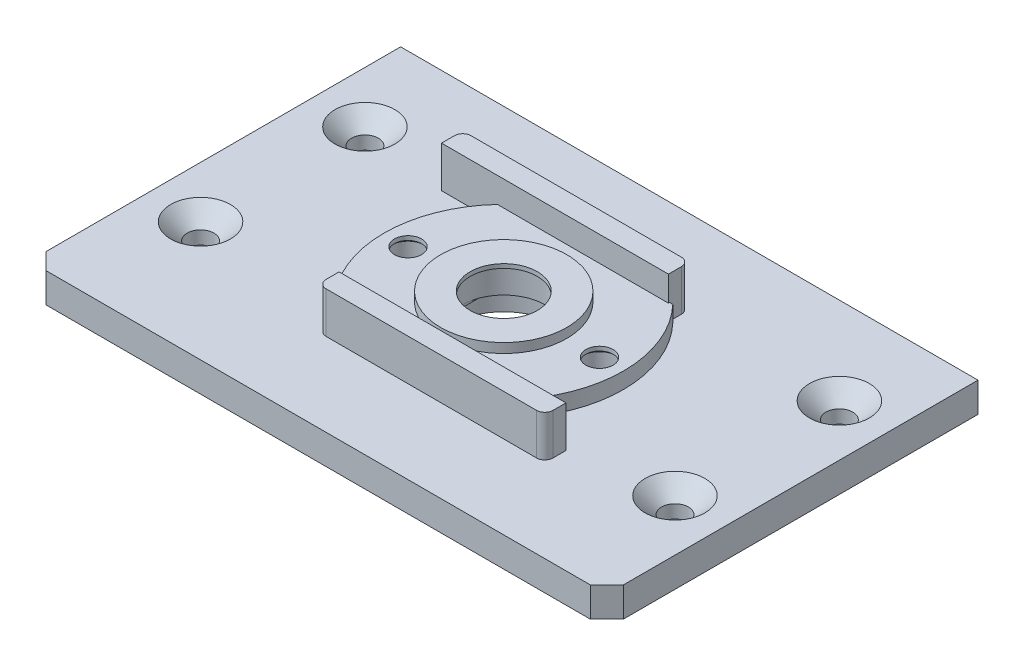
ISO-10303-21;
HEADER;
FILE_DESCRIPTION(('STEP AP214'),'2;1');
FILE_NAME('part.step','',(''),(''),'','','');
FILE_SCHEMA(('AUTOMOTIVE_DESIGN { 1 0 10303 214 1 1 1 1 }'));
ENDSEC;
DATA;
#1=APPLICATION_CONTEXT('core data for automotive mechanical design processes');
#2=APPLICATION_PROTOCOL_DEFINITION('international standard','automotive_design',2000,#1);
#3=PRODUCT_CONTEXT('',#1,'mechanical');
#4=PRODUCT('Part','Part','',(#3));
#5=PRODUCT_RELATED_PRODUCT_CATEGORY('part','',(#4));
#6=PRODUCT_DEFINITION_FORMATION('','',#4);
#7=PRODUCT_DEFINITION_CONTEXT('part definition',#1,'design');
#8=PRODUCT_DEFINITION('design','',#6,#7);
#9=PRODUCT_DEFINITION_SHAPE('','',#8);
#10=(LENGTH_UNIT() NAMED_UNIT(*) SI_UNIT(.MILLI.,.METRE.));
#11=(NAMED_UNIT(*) PLANE_ANGLE_UNIT() SI_UNIT($,.RADIAN.));
#12=(NAMED_UNIT(*) SI_UNIT($,.STERADIAN.) SOLID_ANGLE_UNIT());
#13=UNCERTAINTY_MEASURE_WITH_UNIT(LENGTH_MEASURE(1.E-05),#10,'distance_accuracy_value','');
#14=(GEOMETRIC_REPRESENTATION_CONTEXT(3) GLOBAL_UNCERTAINTY_ASSIGNED_CONTEXT((#13)) GLOBAL_UNIT_ASSIGNED_CONTEXT((#10,
#11,#12)) REPRESENTATION_CONTEXT('',''));
#15=CARTESIAN_POINT('',(0.,0.,0.));
#16=DIRECTION('',(0.,0.,1.));
#17=DIRECTION('',(1.,0.,0.));
#18=AXIS2_PLACEMENT_3D('',#15,#16,#17);
#19=CARTESIAN_POINT('',(0.,-3.6,0.));
#20=DIRECTION('',(0.,1.,0.));
#21=DIRECTION('',(0.,0.,1.));
#22=AXIS2_PLACEMENT_3D('',#19,#20,#21);
#23=CYLINDRICAL_SURFACE('',#22,5.075);
#24=CARTESIAN_POINT('',(0.,2.603,0.));
#25=DIRECTION('',(0.,1.,0.));
#26=DIRECTION('',(0.,0.,1.));
#27=AXIS2_PLACEMENT_3D('',#24,#25,#26);
#28=CIRCLE('',#27,5.075);
#29=CARTESIAN_POINT('',(0.,2.603,5.07499999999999));
#30=VERTEX_POINT('',#29);
#31=EDGE_CURVE('E537',#30,#30,#28,.F.);
#32=ORIENTED_EDGE('',*,*,#31,.F.);
#33=EDGE_LOOP('',(#32));
#34=FACE_BOUND('',#33,.T.);
#35=CARTESIAN_POINT('',(0.,-0.9,0.));
#36=DIRECTION('',(0.,-1.,0.));
#37=DIRECTION('',(0.,0.,-1.));
#38=AXIS2_PLACEMENT_3D('',#35,#36,#37);
#39=CIRCLE('',#38,5.075);
#40=CARTESIAN_POINT('',(5.07499999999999,-0.9,0.));
#41=VERTEX_POINT('',#40);
#42=CARTESIAN_POINT('',(-5.07500000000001,-0.9,0.));
#43=VERTEX_POINT('',#42);
#44=EDGE_CURVE('E274',#41,#43,#39,.T.);
#45=ORIENTED_EDGE('',*,*,#44,.T.);
#46=CARTESIAN_POINT('',(0.,-0.9,0.));
#47=DIRECTION('',(0.,-1.,0.));
#48=DIRECTION('',(0.,0.,-1.));
#49=AXIS2_PLACEMENT_3D('',#46,#47,#48);
#50=CIRCLE('',#49,5.075);
#51=EDGE_CURVE('E279',#43,#41,#50,.T.);
#52=ORIENTED_EDGE('',*,*,#51,.T.);
#53=EDGE_LOOP('',(#45,#52));
#54=FACE_BOUND('',#53,.T.);
#55=ADVANCED_FACE('F43',(#34,#54),#23,.F.);
#56=CARTESIAN_POINT('',(0.,-1.2,0.));
#57=DIRECTION('',(0.,-1.,0.));
#58=DIRECTION('',(0.,0.,-1.));
#59=AXIS2_PLACEMENT_3D('',#56,#57,#58);
#60=PLANE('',#59);
#61=CARTESIAN_POINT('',(0.,-1.2,0.));
#62=DIRECTION('',(0.,-1.,0.));
#63=DIRECTION('',(0.,0.,-1.));
#64=AXIS2_PLACEMENT_3D('',#61,#62,#63);
#65=CIRCLE('',#64,6.404);
#66=CARTESIAN_POINT('',(5.07499999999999,-1.2,-3.90584062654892));
#67=VERTEX_POINT('',#66);
#68=CARTESIAN_POINT('',(5.07499999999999,-1.2,3.9058406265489));
#69=VERTEX_POINT('',#68);
#70=EDGE_CURVE('E285',#67,#69,#65,.T.);
#71=ORIENTED_EDGE('',*,*,#70,.T.);
#72=DIRECTION('',(0.,0.,-1.));
#73=VECTOR('',#72,1.);
#74=CARTESIAN_POINT('',(5.07499999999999,-1.2,0.));
#75=LINE('',#74,#73);
#76=EDGE_CURVE('E11',#69,#67,#75,.T.);
#77=ORIENTED_EDGE('',*,*,#76,.T.);
#78=EDGE_LOOP('',(#71,#77));
#79=FACE_BOUND('',#78,.T.);
#80=ADVANCED_FACE('F560',(#79),#60,.T.);
#81=CARTESIAN_POINT('',(-11.608,1.95,0.));
#82=DIRECTION('',(0.,-1.,0.));
#83=DIRECTION('',(0.,0.,-1.));
#84=AXIS2_PLACEMENT_3D('',#81,#82,#83);
#85=CYLINDRICAL_SURFACE('',#84,2.1);
#86=CARTESIAN_POINT('',(-11.608,1.05000000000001,0.));
#87=DIRECTION('',(0.,1.,0.));
#88=DIRECTION('',(0.,0.,1.));
#89=AXIS2_PLACEMENT_3D('',#86,#87,#88);
#90=CIRCLE('',#89,2.1);
#91=CARTESIAN_POINT('',(-11.608,1.05000000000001,2.1));
#92=VERTEX_POINT('',#91);
#93=EDGE_CURVE('E247',#92,#92,#90,.T.);
#94=ORIENTED_EDGE('',*,*,#93,.T.);
#95=EDGE_LOOP('',(#94));
#96=FACE_BOUND('',#95,.T.);
#97=CARTESIAN_POINT('',(-11.608,-3.6,0.));
#98=DIRECTION('',(0.,-1.,0.));
#99=DIRECTION('',(0.,0.,-1.));
#100=AXIS2_PLACEMENT_3D('',#97,#98,#99);
#101=CIRCLE('',#100,2.1);
#102=CARTESIAN_POINT('',(-11.608,-3.6,-2.1));
#103=VERTEX_POINT('',#102);
#104=EDGE_CURVE('E324',#103,#103,#101,.F.);
#105=ORIENTED_EDGE('',*,*,#104,.F.);
#106=EDGE_LOOP('',(#105));
#107=FACE_BOUND('',#106,.T.);
#108=ADVANCED_FACE('F567',(#96,#107),#85,.F.);
#109=CARTESIAN_POINT('',(11.608,1.95,0.));
#110=DIRECTION('',(0.,-1.,0.));
#111=DIRECTION('',(0.,0.,-1.));
#112=AXIS2_PLACEMENT_3D('',#109,#110,#111);
#113=CYLINDRICAL_SURFACE('',#112,2.1);
#114=CARTESIAN_POINT('',(11.608,1.05000000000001,0.));
#115=DIRECTION('',(0.,1.,0.));
#116=DIRECTION('',(0.,0.,1.));
#117=AXIS2_PLACEMENT_3D('',#114,#115,#116);
#118=CIRCLE('',#117,2.1);
#119=CARTESIAN_POINT('',(11.608,1.05000000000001,2.1));
#120=VERTEX_POINT('',#119);
#121=EDGE_CURVE('E489',#120,#120,#118,.T.);
#122=ORIENTED_EDGE('',*,*,#121,.T.);
#123=EDGE_LOOP('',(#122));
#124=FACE_BOUND('',#123,.T.);
#125=CARTESIAN_POINT('',(11.608,-3.6,0.));
#126=DIRECTION('',(0.,-1.,0.));
#127=DIRECTION('',(0.,0.,-1.));
#128=AXIS2_PLACEMENT_3D('',#125,#126,#127);
#129=CIRCLE('',#128,2.1);
#130=CARTESIAN_POINT('',(11.608,-3.6,-2.1));
#131=VERTEX_POINT('',#130);
#132=EDGE_CURVE('E327',#131,#131,#129,.F.);
#133=ORIENTED_EDGE('',*,*,#132,.F.);
#134=EDGE_LOOP('',(#133));
#135=FACE_BOUND('',#134,.T.);
#136=ADVANCED_FACE('F629',(#124,#135),#113,.F.);
#137=CARTESIAN_POINT('',(0.,-3.6,0.));
#138=DIRECTION('',(0.,1.,0.));
#139=DIRECTION('',(0.,0.,1.));
#140=AXIS2_PLACEMENT_3D('',#137,#138,#139);
#141=CYLINDRICAL_SURFACE('',#140,6.404);
#142=DIRECTION('',(0.,1.,0.));
#143=VECTOR('',#142,1.);
#144=CARTESIAN_POINT('',(5.07499999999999,-3.6,-3.90584062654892));
#145=LINE('',#144,#143);
#146=CARTESIAN_POINT('',(5.07499999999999,-0.9,-3.90584062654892));
#147=VERTEX_POINT('',#146);
#148=EDGE_CURVE('E59',#67,#147,#145,.T.);
#149=ORIENTED_EDGE('',*,*,#148,.T.);
#150=CARTESIAN_POINT('',(0.,-0.9,0.));
#151=DIRECTION('',(0.,-1.,0.));
#152=DIRECTION('',(0.,0.,-1.));
#153=AXIS2_PLACEMENT_3D('',#150,#151,#152);
#154=CIRCLE('',#153,6.404);
#155=CARTESIAN_POINT('',(-5.07500000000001,-0.9,-3.90584062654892));
#156=VERTEX_POINT('',#155);
#157=EDGE_CURVE('E248',#156,#147,#154,.T.);
#158=ORIENTED_EDGE('',*,*,#157,.F.);
#159=DIRECTION('',(0.,1.,0.));
#160=VECTOR('',#159,1.);
#161=CARTESIAN_POINT('',(-5.07500000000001,-3.6,-3.90584062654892));
#162=LINE('',#161,#160);
#163=CARTESIAN_POINT('',(-5.07500000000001,-1.2,-3.90584062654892));
#164=VERTEX_POINT('',#163);
#165=EDGE_CURVE('E66',#164,#156,#162,.T.);
#166=ORIENTED_EDGE('',*,*,#165,.F.);
#167=CARTESIAN_POINT('',(0.,-1.2,0.));
#168=DIRECTION('',(0.,-1.,0.));
#169=DIRECTION('',(0.,0.,-1.));
#170=AXIS2_PLACEMENT_3D('',#167,#168,#169);
#171=CIRCLE('',#170,6.404);
#172=CARTESIAN_POINT('',(-5.07500000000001,-1.2,3.9058406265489));
#173=VERTEX_POINT('',#172);
#174=EDGE_CURVE('E255',#173,#164,#171,.T.);
#175=ORIENTED_EDGE('',*,*,#174,.F.);
#176=DIRECTION('',(0.,1.,0.));
#177=VECTOR('',#176,1.);
#178=CARTESIAN_POINT('',(-5.07500000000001,-3.6,3.9058406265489));
#179=LINE('',#178,#177);
#180=CARTESIAN_POINT('',(-5.07500000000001,-0.9,3.9058406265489));
#181=VERTEX_POINT('',#180);
#182=EDGE_CURVE('E251',#173,#181,#179,.T.);
#183=ORIENTED_EDGE('',*,*,#182,.T.);
#184=CARTESIAN_POINT('',(5.07499999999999,-0.9,3.9058406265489));
#185=VERTEX_POINT('',#184);
#186=EDGE_CURVE('E236',#185,#181,#154,.T.);
#187=ORIENTED_EDGE('',*,*,#186,.F.);
#188=DIRECTION('',(0.,1.,0.));
#189=VECTOR('',#188,1.);
#190=CARTESIAN_POINT('',(5.07499999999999,-3.6,3.9058406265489));
#191=LINE('',#190,#189);
#192=EDGE_CURVE('E267',#69,#185,#191,.T.);
#193=ORIENTED_EDGE('',*,*,#192,.F.);
#194=ORIENTED_EDGE('',*,*,#70,.F.);
#195=EDGE_LOOP('',(#149,#158,#166,#175,#183,#187,#193,#194));
#196=FACE_BOUND('',#195,.T.);
#197=CARTESIAN_POINT('',(0.,-3.6,0.));
#198=DIRECTION('',(0.,-1.,0.));
#199=DIRECTION('',(0.,0.,-1.));
#200=AXIS2_PLACEMENT_3D('',#197,#198,#199);
#201=CIRCLE('',#200,6.404);
#202=CARTESIAN_POINT('',(0.,-3.6,-6.40400000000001));
#203=VERTEX_POINT('',#202);
#204=EDGE_CURVE('E321',#203,#203,#201,.T.);
#205=ORIENTED_EDGE('',*,*,#204,.T.);
#206=EDGE_LOOP('',(#205));
#207=FACE_BOUND('',#206,.T.);
#208=ADVANCED_FACE('F252',(#196,#207),#141,.F.);
#209=CARTESIAN_POINT('',(0.,-0.9,0.));
#210=DIRECTION('',(0.,-1.,0.));
#211=DIRECTION('',(0.,0.,-1.));
#212=AXIS2_PLACEMENT_3D('',#209,#210,#211);
#213=PLANE('',#212);
#214=ORIENTED_EDGE('',*,*,#51,.F.);
#215=DIRECTION('',(0.,0.,1.));
#216=VECTOR('',#215,1.);
#217=CARTESIAN_POINT('',(-5.07500000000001,-0.9,0.));
#218=LINE('',#217,#216);
#219=EDGE_CURVE('E261',#156,#43,#218,.T.);
#220=ORIENTED_EDGE('',*,*,#219,.F.);
#221=ORIENTED_EDGE('',*,*,#157,.T.);
#222=DIRECTION('',(0.,0.,1.));
#223=VECTOR('',#222,1.);
#224=CARTESIAN_POINT('',(5.07499999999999,-0.9,0.));
#225=LINE('',#224,#223);
#226=EDGE_CURVE('E264',#147,#41,#225,.T.);
#227=ORIENTED_EDGE('',*,*,#226,.T.);
#228=EDGE_LOOP('',(#214,#220,#221,#227));
#229=FACE_BOUND('',#228,.T.);
#230=ADVANCED_FACE('F899',(#229),#213,.T.);
#231=ORIENTED_EDGE('',*,*,#44,.F.);
#232=EDGE_CURVE('E244',#41,#185,#225,.T.);
#233=ORIENTED_EDGE('',*,*,#232,.T.);
#234=ORIENTED_EDGE('',*,*,#186,.T.);
#235=EDGE_CURVE('E241',#43,#181,#218,.T.);
#236=ORIENTED_EDGE('',*,*,#235,.F.);
#237=EDGE_LOOP('',(#231,#233,#234,#236));
#238=FACE_BOUND('',#237,.T.);
#239=ADVANCED_FACE('F239',(#238),#213,.T.);
#240=CARTESIAN_POINT('',(0.,1.95,0.));
#241=DIRECTION('',(0.,-1.,0.));
#242=DIRECTION('',(0.,0.,-1.));
#243=AXIS2_PLACEMENT_3D('',#240,#241,#242);
#244=CYLINDRICAL_SURFACE('',#243,14.5);
#245=DIRECTION('',(0.,-1.,0.));
#246=VECTOR('',#245,1.);
#247=CARTESIAN_POINT('',(10.6260079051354,1.95,9.866));
#248=LINE('',#247,#246);
#249=CARTESIAN_POINT('',(10.6260079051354,0.,9.866));
#250=VERTEX_POINT('',#249);
#251=CARTESIAN_POINT('',(10.6260079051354,1.95,9.866));
#252=VERTEX_POINT('',#251);
#253=EDGE_CURVE('E401',#250,#252,#248,.F.);
#254=ORIENTED_EDGE('',*,*,#253,.F.);
#255=CARTESIAN_POINT('',(0.,0.,0.));
#256=DIRECTION('',(0.,1.,0.));
#257=DIRECTION('',(0.,0.,1.));
#258=AXIS2_PLACEMENT_3D('',#255,#256,#257);
#259=CIRCLE('',#258,14.5);
#260=CARTESIAN_POINT('',(10.5,0.,-10.));
#261=VERTEX_POINT('',#260);
#262=EDGE_CURVE('E425',#250,#261,#259,.T.);
#263=ORIENTED_EDGE('',*,*,#262,.T.);
#264=DIRECTION('',(0.,-1.,0.));
#265=VECTOR('',#264,1.);
#266=CARTESIAN_POINT('',(10.5,1.95,-10.));
#267=LINE('',#266,#265);
#268=CARTESIAN_POINT('',(10.5,1.95,-10.));
#269=VERTEX_POINT('',#268);
#270=EDGE_CURVE('E432',#269,#261,#267,.T.);
#271=ORIENTED_EDGE('',*,*,#270,.F.);
#272=CARTESIAN_POINT('',(0.,1.95,0.));
#273=DIRECTION('',(0.,1.,0.));
#274=DIRECTION('',(0.,0.,1.));
#275=AXIS2_PLACEMENT_3D('',#272,#273,#274);
#276=CIRCLE('',#275,14.5);
#277=EDGE_CURVE('E417',#252,#269,#276,.T.);
#278=ORIENTED_EDGE('',*,*,#277,.F.);
#279=EDGE_LOOP('',(#254,#263,#271,#278));
#280=FACE_BOUND('',#279,.T.);
#281=ADVANCED_FACE('F607',(#280),#244,.T.);
#282=DIRECTION('',(0.,-1.,0.));
#283=VECTOR('',#282,1.);
#284=CARTESIAN_POINT('',(-10.6260079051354,1.95,-9.866));
#285=LINE('',#284,#283);
#286=CARTESIAN_POINT('',(-10.6260079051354,0.,-9.866));
#287=VERTEX_POINT('',#286);
#288=CARTESIAN_POINT('',(-10.6260079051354,1.95,-9.866));
#289=VERTEX_POINT('',#288);
#290=EDGE_CURVE('E407',#287,#289,#285,.F.);
#291=ORIENTED_EDGE('',*,*,#290,.F.);
#292=CARTESIAN_POINT('',(-10.5,0.,10.));
#293=VERTEX_POINT('',#292);
#294=EDGE_CURVE('E415',#287,#293,#259,.T.);
#295=ORIENTED_EDGE('',*,*,#294,.T.);
#296=DIRECTION('',(0.,-1.,0.));
#297=VECTOR('',#296,1.);
#298=CARTESIAN_POINT('',(-10.5,1.95,10.));
#299=LINE('',#298,#297);
#300=CARTESIAN_POINT('',(-10.5,1.95,10.));
#301=VERTEX_POINT('',#300);
#302=EDGE_CURVE('E420',#301,#293,#299,.T.);
#303=ORIENTED_EDGE('',*,*,#302,.F.);
#304=EDGE_CURVE('E418',#289,#301,#276,.T.);
#305=ORIENTED_EDGE('',*,*,#304,.F.);
#306=EDGE_LOOP('',(#291,#295,#303,#305));
#307=FACE_BOUND('',#306,.T.);
#308=ADVANCED_FACE('F595',(#307),#244,.T.);
#309=CARTESIAN_POINT('',(0.,1.95,0.));
#310=DIRECTION('',(0.,1.,0.));
#311=DIRECTION('',(0.,0.,1.));
#312=AXIS2_PLACEMENT_3D('',#309,#310,#311);
#313=PLANE('',#312);
#314=CARTESIAN_POINT('',(0.,1.95,0.));
#315=DIRECTION('',(0.,1.,0.));
#316=DIRECTION('',(0.,0.,1.));
#317=AXIS2_PLACEMENT_3D('',#314,#315,#316);
#318=CIRCLE('',#317,7.65);
#319=CARTESIAN_POINT('',(0.,1.95,7.64999999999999));
#320=VERTEX_POINT('',#319);
#321=EDGE_CURVE('E411',#320,#320,#318,.T.);
#322=ORIENTED_EDGE('',*,*,#321,.F.);
#323=EDGE_LOOP('',(#322));
#324=FACE_BOUND('',#323,.T.);
#325=DIRECTION('',(0.,0.,-1.));
#326=VECTOR('',#325,1.);
#327=CARTESIAN_POINT('',(10.099911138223,1.95,0.));
#328=LINE('',#327,#326);
#329=CARTESIAN_POINT('',(10.099911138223,1.95,-9.866));
#330=VERTEX_POINT('',#329);
#331=CARTESIAN_POINT('',(10.099911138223,1.95,-10.));
#332=VERTEX_POINT('',#331);
#333=EDGE_CURVE('E443',#330,#332,#328,.T.);
#334=ORIENTED_EDGE('',*,*,#333,.F.);
#335=DIRECTION('',(-1.,0.,0.));
#336=VECTOR('',#335,1.);
#337=CARTESIAN_POINT('',(0.,1.95,-9.866));
#338=LINE('',#337,#336);
#339=EDGE_CURVE('E446',#330,#289,#338,.T.);
#340=ORIENTED_EDGE('',*,*,#339,.T.);
#341=ORIENTED_EDGE('',*,*,#304,.T.);
#342=DIRECTION('',(1.,0.,0.));
#343=VECTOR('',#342,1.);
#344=CARTESIAN_POINT('',(0.,1.95,10.));
#345=LINE('',#344,#343);
#346=CARTESIAN_POINT('',(-10.099911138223,1.95,10.));
#347=VERTEX_POINT('',#346);
#348=EDGE_CURVE('E414',#301,#347,#345,.T.);
#349=ORIENTED_EDGE('',*,*,#348,.T.);
#350=DIRECTION('',(0.,0.,1.));
#351=VECTOR('',#350,1.);
#352=CARTESIAN_POINT('',(-10.099911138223,1.95,0.));
#353=LINE('',#352,#351);
#354=CARTESIAN_POINT('',(-10.099911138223,1.95,9.86599999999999));
#355=VERTEX_POINT('',#354);
#356=EDGE_CURVE('E438',#355,#347,#353,.T.);
#357=ORIENTED_EDGE('',*,*,#356,.F.);
#358=DIRECTION('',(1.,0.,0.));
#359=VECTOR('',#358,1.);
#360=CARTESIAN_POINT('',(0.,1.95,9.866));
#361=LINE('',#360,#359);
#362=EDGE_CURVE('E441',#355,#252,#361,.T.);
#363=ORIENTED_EDGE('',*,*,#362,.T.);
#364=ORIENTED_EDGE('',*,*,#277,.T.);
#365=DIRECTION('',(1.,0.,0.));
#366=VECTOR('',#365,1.);
#367=CARTESIAN_POINT('',(0.,1.95,-10.));
#368=LINE('',#367,#366);
#369=EDGE_CURVE('E421',#332,#269,#368,.T.);
#370=ORIENTED_EDGE('',*,*,#369,.F.);
#371=EDGE_LOOP('',(#334,#340,#341,#349,#357,#363,#364,#370));
#372=FACE_BOUND('',#371,.T.);
#373=CARTESIAN_POINT('',(11.608,1.95,0.));
#374=DIRECTION('',(0.,1.,0.));
#375=DIRECTION('',(0.,0.,1.));
#376=AXIS2_PLACEMENT_3D('',#373,#374,#375);
#377=CIRCLE('',#376,1.65);
#378=CARTESIAN_POINT('',(11.608,1.95,1.65));
#379=VERTEX_POINT('',#378);
#380=EDGE_CURVE('E289',#379,#379,#377,.T.);
#381=ORIENTED_EDGE('',*,*,#380,.F.);
#382=EDGE_LOOP('',(#381));
#383=FACE_BOUND('',#382,.T.);
#384=CARTESIAN_POINT('',(-11.608,1.95,0.));
#385=DIRECTION('',(0.,1.,0.));
#386=DIRECTION('',(0.,0.,1.));
#387=AXIS2_PLACEMENT_3D('',#384,#385,#386);
#388=CIRCLE('',#387,1.65);
#389=CARTESIAN_POINT('',(-11.608,1.95,1.65));
#390=VERTEX_POINT('',#389);
#391=EDGE_CURVE('E286',#390,#390,#388,.T.);
#392=ORIENTED_EDGE('',*,*,#391,.F.);
#393=EDGE_LOOP('',(#392));
#394=FACE_BOUND('',#393,.T.);
#395=ADVANCED_FACE('F592',(#324,#372,#383,#394),#313,.T.);
#396=CARTESIAN_POINT('',(0.,3.103,0.));
#397=DIRECTION('',(0.,-1.,0.));
#398=DIRECTION('',(0.,0.,-1.));
#399=AXIS2_PLACEMENT_3D('',#396,#397,#398);
#400=CYLINDRICAL_SURFACE('',#399,7.65);
#401=ORIENTED_EDGE('',*,*,#321,.T.);
#402=EDGE_LOOP('',(#401));
#403=FACE_BOUND('',#402,.T.);
#404=CARTESIAN_POINT('',(0.,3.103,0.));
#405=DIRECTION('',(0.,1.,0.));
#406=DIRECTION('',(0.,0.,1.));
#407=AXIS2_PLACEMENT_3D('',#404,#405,#406);
#408=CIRCLE('',#407,7.65);
#409=CARTESIAN_POINT('',(0.,3.103,7.64999999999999));
#410=VERTEX_POINT('',#409);
#411=EDGE_CURVE('E435',#410,#410,#408,.T.);
#412=ORIENTED_EDGE('',*,*,#411,.F.);
#413=EDGE_LOOP('',(#412));
#414=FACE_BOUND('',#413,.T.);
#415=ADVANCED_FACE('F594',(#403,#414),#400,.T.);
#416=CARTESIAN_POINT('',(0.,3.103,0.));
#417=DIRECTION('',(0.,1.,0.));
#418=DIRECTION('',(0.,0.,1.));
#419=AXIS2_PLACEMENT_3D('',#416,#417,#418);
#420=PLANE('',#419);
#421=ORIENTED_EDGE('',*,*,#411,.T.);
#422=EDGE_LOOP('',(#421));
#423=FACE_BOUND('',#422,.T.);
#424=CARTESIAN_POINT('',(0.,3.103,0.));
#425=DIRECTION('',(0.,1.,0.));
#426=DIRECTION('',(0.,0.,1.));
#427=AXIS2_PLACEMENT_3D('',#424,#425,#426);
#428=CIRCLE('',#427,4.075);
#429=CARTESIAN_POINT('',(0.,3.103,4.07499999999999));
#430=VERTEX_POINT('',#429);
#431=EDGE_CURVE('E257',#430,#430,#428,.T.);
#432=ORIENTED_EDGE('',*,*,#431,.F.);
#433=EDGE_LOOP('',(#432));
#434=FACE_BOUND('',#433,.T.);
#435=ADVANCED_FACE('F603',(#423,#434),#420,.T.);
#436=CARTESIAN_POINT('',(0.,1.95,10.));
#437=DIRECTION('',(0.,0.,-1.));
#438=DIRECTION('',(-1.,0.,0.));
#439=AXIS2_PLACEMENT_3D('',#436,#437,#438);
#440=PLANE('',#439);
#441=DIRECTION('',(1.,0.,0.));
#442=VECTOR('',#441,1.);
#443=CARTESIAN_POINT('',(0.,0.,10.));
#444=LINE('',#443,#442);
#445=CARTESIAN_POINT('',(-10.099911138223,0.,10.));
#446=VERTEX_POINT('',#445);
#447=EDGE_CURVE('E410',#293,#446,#444,.T.);
#448=ORIENTED_EDGE('',*,*,#447,.T.);
#449=DIRECTION('',(0.,1.,0.));
#450=VECTOR('',#449,1.);
#451=CARTESIAN_POINT('',(-10.099911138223,1.95,10.));
#452=LINE('',#451,#450);
#453=EDGE_CURVE('E374',#446,#347,#452,.T.);
#454=ORIENTED_EDGE('',*,*,#453,.T.);
#455=ORIENTED_EDGE('',*,*,#348,.F.);
#456=ORIENTED_EDGE('',*,*,#302,.T.);
#457=EDGE_LOOP('',(#448,#454,#455,#456));
#458=FACE_BOUND('',#457,.T.);
#459=ADVANCED_FACE('F622',(#458),#440,.F.);
#460=CARTESIAN_POINT('',(0.,1.95,-10.));
#461=DIRECTION('',(0.,0.,-1.));
#462=DIRECTION('',(-1.,0.,0.));
#463=AXIS2_PLACEMENT_3D('',#460,#461,#462);
#464=PLANE('',#463);
#465=DIRECTION('',(0.,-1.,0.));
#466=VECTOR('',#465,1.);
#467=CARTESIAN_POINT('',(10.099911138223,1.95,-10.));
#468=LINE('',#467,#466);
#469=CARTESIAN_POINT('',(10.099911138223,0.,-10.));
#470=VERTEX_POINT('',#469);
#471=EDGE_CURVE('E404',#332,#470,#468,.T.);
#472=ORIENTED_EDGE('',*,*,#471,.F.);
#473=ORIENTED_EDGE('',*,*,#369,.T.);
#474=ORIENTED_EDGE('',*,*,#270,.T.);
#475=DIRECTION('',(1.,0.,0.));
#476=VECTOR('',#475,1.);
#477=CARTESIAN_POINT('',(0.,0.,-10.));
#478=LINE('',#477,#476);
#479=EDGE_CURVE('E428',#470,#261,#478,.T.);
#480=ORIENTED_EDGE('',*,*,#479,.F.);
#481=EDGE_LOOP('',(#472,#473,#474,#480));
#482=FACE_BOUND('',#481,.T.);
#483=ADVANCED_FACE('F618',(#482),#464,.T.);
#484=CARTESIAN_POINT('',(17.409088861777,5.,9.866));
#485=DIRECTION('',(0.,0.,1.));
#486=DIRECTION('',(1.,0.,0.));
#487=AXIS2_PLACEMENT_3D('',#484,#485,#486);
#488=PLANE('',#487);
#489=DIRECTION('',(-1.,0.,0.));
#490=VECTOR('',#489,1.);
#491=CARTESIAN_POINT('',(17.409088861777,0.,9.866));
#492=LINE('',#491,#490);
#493=CARTESIAN_POINT('',(17.409088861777,0.,9.866));
#494=VERTEX_POINT('',#493);
#495=EDGE_CURVE('E383',#494,#250,#492,.T.);
#496=ORIENTED_EDGE('',*,*,#495,.T.);
#497=ORIENTED_EDGE('',*,*,#253,.T.);
#498=ORIENTED_EDGE('',*,*,#362,.F.);
#499=DIRECTION('',(0.,-1.,0.));
#500=VECTOR('',#499,1.);
#501=CARTESIAN_POINT('',(-10.099911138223,5.,9.86599999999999));
#502=LINE('',#501,#500);
#503=CARTESIAN_POINT('',(-10.099911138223,5.,9.86599999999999));
#504=VERTEX_POINT('',#503);
#505=EDGE_CURVE('E375',#504,#355,#502,.T.);
#506=ORIENTED_EDGE('',*,*,#505,.F.);
#507=DIRECTION('',(-1.,0.,0.));
#508=VECTOR('',#507,1.);
#509=CARTESIAN_POINT('',(17.409088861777,5.,9.866));
#510=LINE('',#509,#508);
#511=CARTESIAN_POINT('',(17.409088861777,5.,9.866));
#512=VERTEX_POINT('',#511);
#513=EDGE_CURVE('E392',#512,#504,#510,.T.);
#514=ORIENTED_EDGE('',*,*,#513,.F.);
#515=DIRECTION('',(0.,-1.,0.));
#516=VECTOR('',#515,1.);
#517=CARTESIAN_POINT('',(17.409088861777,5.,9.866));
#518=LINE('',#517,#516);
#519=EDGE_CURVE('E346',#512,#494,#518,.T.);
#520=ORIENTED_EDGE('',*,*,#519,.T.);
#521=EDGE_LOOP('',(#496,#497,#498,#506,#514,#520));
#522=FACE_BOUND('',#521,.T.);
#523=ADVANCED_FACE('F621',(#522),#488,.F.);
#524=CARTESIAN_POINT('',(-10.099911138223,5.,12.432));
#525=DIRECTION('',(-1.,0.,0.));
#526=DIRECTION('',(0.,0.,1.));
#527=AXIS2_PLACEMENT_3D('',#524,#525,#526);
#528=PLANE('',#527);
#529=DIRECTION('',(0.,0.,-1.));
#530=VECTOR('',#529,1.);
#531=CARTESIAN_POINT('',(-10.099911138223,0.,12.432));
#532=LINE('',#531,#530);
#533=CARTESIAN_POINT('',(-10.099911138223,0.,11.432));
#534=VERTEX_POINT('',#533);
#535=EDGE_CURVE('E387',#534,#446,#532,.T.);
#536=ORIENTED_EDGE('',*,*,#535,.F.);
#537=DIRECTION('',(0.,-1.,0.));
#538=VECTOR('',#537,1.);
#539=CARTESIAN_POINT('',(-10.099911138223,5.,11.432));
#540=LINE('',#539,#538);
#541=CARTESIAN_POINT('',(-10.099911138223,5.,11.432));
#542=VERTEX_POINT('',#541);
#543=EDGE_CURVE('E474',#534,#542,#540,.F.);
#544=ORIENTED_EDGE('',*,*,#543,.T.);
#545=DIRECTION('',(0.,0.,-1.));
#546=VECTOR('',#545,1.);
#547=CARTESIAN_POINT('',(-10.099911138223,5.,12.432));
#548=LINE('',#547,#546);
#549=EDGE_CURVE('E395',#542,#504,#548,.T.);
#550=ORIENTED_EDGE('',*,*,#549,.T.);
#551=ORIENTED_EDGE('',*,*,#505,.T.);
#552=ORIENTED_EDGE('',*,*,#356,.T.);
#553=ORIENTED_EDGE('',*,*,#453,.F.);
#554=EDGE_LOOP('',(#536,#544,#550,#551,#552,#553));
#555=FACE_BOUND('',#554,.T.);
#556=ADVANCED_FACE('F789',(#555),#528,.T.);
#557=CARTESIAN_POINT('',(17.409088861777,5.,12.432));
#558=DIRECTION('',(0.,0.,1.));
#559=DIRECTION('',(1.,0.,0.));
#560=AXIS2_PLACEMENT_3D('',#557,#558,#559);
#561=PLANE('',#560);
#562=DIRECTION('',(-1.,0.,0.));
#563=VECTOR('',#562,1.);
#564=CARTESIAN_POINT('',(17.409088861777,0.,12.432));
#565=LINE('',#564,#563);
#566=CARTESIAN_POINT('',(16.409088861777,0.,12.432));
#567=VERTEX_POINT('',#566);
#568=CARTESIAN_POINT('',(-9.09991113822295,0.,12.432));
#569=VERTEX_POINT('',#568);
#570=EDGE_CURVE('E362',#567,#569,#565,.T.);
#571=ORIENTED_EDGE('',*,*,#570,.F.);
#572=DIRECTION('',(0.,-1.,0.));
#573=VECTOR('',#572,1.);
#574=CARTESIAN_POINT('',(16.409088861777,5.,12.432));
#575=LINE('',#574,#573);
#576=CARTESIAN_POINT('',(16.409088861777,5.,12.432));
#577=VERTEX_POINT('',#576);
#578=EDGE_CURVE('E468',#567,#577,#575,.F.);
#579=ORIENTED_EDGE('',*,*,#578,.T.);
#580=DIRECTION('',(-1.,0.,0.));
#581=VECTOR('',#580,1.);
#582=CARTESIAN_POINT('',(17.409088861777,5.,12.432));
#583=LINE('',#582,#581);
#584=CARTESIAN_POINT('',(-9.09991113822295,5.,12.432));
#585=VERTEX_POINT('',#584);
#586=EDGE_CURVE('E384',#577,#585,#583,.T.);
#587=ORIENTED_EDGE('',*,*,#586,.T.);
#588=DIRECTION('',(0.,-1.,0.));
#589=VECTOR('',#588,1.);
#590=CARTESIAN_POINT('',(-9.09991113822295,5.,12.432));
#591=LINE('',#590,#589);
#592=EDGE_CURVE('E465',#585,#569,#591,.T.);
#593=ORIENTED_EDGE('',*,*,#592,.T.);
#594=EDGE_LOOP('',(#571,#579,#587,#593));
#595=FACE_BOUND('',#594,.T.);
#596=ADVANCED_FACE('F785',(#595),#561,.T.);
#597=CARTESIAN_POINT('',(17.409088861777,5.,12.432));
#598=DIRECTION('',(-1.,0.,0.));
#599=DIRECTION('',(0.,0.,1.));
#600=AXIS2_PLACEMENT_3D('',#597,#598,#599);
#601=PLANE('',#600);
#602=DIRECTION('',(0.,0.,-1.));
#603=VECTOR('',#602,1.);
#604=CARTESIAN_POINT('',(17.409088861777,5.,12.432));
#605=LINE('',#604,#603);
#606=CARTESIAN_POINT('',(17.409088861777,5.,11.432));
#607=VERTEX_POINT('',#606);
#608=EDGE_CURVE('E378',#607,#512,#605,.T.);
#609=ORIENTED_EDGE('',*,*,#608,.F.);
#610=DIRECTION('',(0.,-1.,0.));
#611=VECTOR('',#610,1.);
#612=CARTESIAN_POINT('',(17.409088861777,0.,11.432));
#613=LINE('',#612,#611);
#614=CARTESIAN_POINT('',(17.409088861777,0.,11.432));
#615=VERTEX_POINT('',#614);
#616=EDGE_CURVE('E462',#607,#615,#613,.T.);
#617=ORIENTED_EDGE('',*,*,#616,.T.);
#618=DIRECTION('',(0.,0.,-1.));
#619=VECTOR('',#618,1.);
#620=CARTESIAN_POINT('',(17.409088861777,0.,12.432));
#621=LINE('',#620,#619);
#622=EDGE_CURVE('E381',#615,#494,#621,.T.);
#623=ORIENTED_EDGE('',*,*,#622,.T.);
#624=ORIENTED_EDGE('',*,*,#519,.F.);
#625=EDGE_LOOP('',(#609,#617,#623,#624));
#626=FACE_BOUND('',#625,.T.);
#627=ADVANCED_FACE('F788',(#626),#601,.F.);
#628=CARTESIAN_POINT('',(0.,5.,0.));
#629=DIRECTION('',(0.,-1.,0.));
#630=DIRECTION('',(0.,0.,-1.));
#631=AXIS2_PLACEMENT_3D('',#628,#629,#630);
#632=PLANE('',#631);
#633=ORIENTED_EDGE('',*,*,#586,.F.);
#634=CARTESIAN_POINT('',(16.409088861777,5.,11.432));
#635=DIRECTION('',(0.,-1.,0.));
#636=DIRECTION('',(0.,0.,-1.));
#637=AXIS2_PLACEMENT_3D('',#634,#635,#636);
#638=CIRCLE('',#637,1.);
#639=EDGE_CURVE('E472',#577,#607,#638,.F.);
#640=ORIENTED_EDGE('',*,*,#639,.T.);
#641=ORIENTED_EDGE('',*,*,#608,.T.);
#642=ORIENTED_EDGE('',*,*,#513,.T.);
#643=ORIENTED_EDGE('',*,*,#549,.F.);
#644=CARTESIAN_POINT('',(-9.09991113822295,5.,11.432));
#645=DIRECTION('',(0.,-1.,0.));
#646=DIRECTION('',(0.,0.,-1.));
#647=AXIS2_PLACEMENT_3D('',#644,#645,#646);
#648=CIRCLE('',#647,1.);
#649=EDGE_CURVE('E470',#542,#585,#648,.F.);
#650=ORIENTED_EDGE('',*,*,#649,.T.);
#651=EDGE_LOOP('',(#633,#640,#641,#642,#643,#650));
#652=FACE_BOUND('',#651,.T.);
#653=ADVANCED_FACE('F613',(#652),#632,.F.);
#654=CARTESIAN_POINT('',(-17.4090888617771,5.,-9.866));
#655=DIRECTION('',(0.,0.,-1.));
#656=DIRECTION('',(-1.,0.,0.));
#657=AXIS2_PLACEMENT_3D('',#654,#655,#656);
#658=PLANE('',#657);
#659=DIRECTION('',(1.,0.,0.));
#660=VECTOR('',#659,1.);
#661=CARTESIAN_POINT('',(-17.4090888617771,0.,-9.866));
#662=LINE('',#661,#660);
#663=CARTESIAN_POINT('',(-17.4090888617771,0.,-9.866));
#664=VERTEX_POINT('',#663);
#665=EDGE_CURVE('E361',#664,#287,#662,.T.);
#666=ORIENTED_EDGE('',*,*,#665,.T.);
#667=ORIENTED_EDGE('',*,*,#290,.T.);
#668=ORIENTED_EDGE('',*,*,#339,.F.);
#669=DIRECTION('',(0.,-1.,0.));
#670=VECTOR('',#669,1.);
#671=CARTESIAN_POINT('',(10.099911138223,5.,-9.866));
#672=LINE('',#671,#670);
#673=CARTESIAN_POINT('',(10.099911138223,5.,-9.866));
#674=VERTEX_POINT('',#673);
#675=EDGE_CURVE('E358',#674,#330,#672,.T.);
#676=ORIENTED_EDGE('',*,*,#675,.F.);
#677=DIRECTION('',(1.,0.,0.));
#678=VECTOR('',#677,1.);
#679=CARTESIAN_POINT('',(-17.4090888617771,5.,-9.866));
#680=LINE('',#679,#678);
#681=CARTESIAN_POINT('',(-17.4090888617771,5.,-9.866));
#682=VERTEX_POINT('',#681);
#683=EDGE_CURVE('E349',#682,#674,#680,.T.);
#684=ORIENTED_EDGE('',*,*,#683,.F.);
#685=DIRECTION('',(0.,-1.,0.));
#686=VECTOR('',#685,1.);
#687=CARTESIAN_POINT('',(-17.4090888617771,5.,-9.866));
#688=LINE('',#687,#686);
#689=EDGE_CURVE('E371',#682,#664,#688,.T.);
#690=ORIENTED_EDGE('',*,*,#689,.T.);
#691=EDGE_LOOP('',(#666,#667,#668,#676,#684,#690));
#692=FACE_BOUND('',#691,.T.);
#693=ADVANCED_FACE('F779',(#692),#658,.F.);
#694=CARTESIAN_POINT('',(-17.409088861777,5.,-12.432));
#695=DIRECTION('',(1.,0.,0.));
#696=DIRECTION('',(0.,0.,-1.));
#697=AXIS2_PLACEMENT_3D('',#694,#695,#696);
#698=PLANE('',#697);
#699=DIRECTION('',(0.,0.,1.));
#700=VECTOR('',#699,1.);
#701=CARTESIAN_POINT('',(-17.409088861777,5.,-12.432));
#702=LINE('',#701,#700);
#703=CARTESIAN_POINT('',(-17.409088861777,5.,-11.432));
#704=VERTEX_POINT('',#703);
#705=EDGE_CURVE('E347',#704,#682,#702,.T.);
#706=ORIENTED_EDGE('',*,*,#705,.F.);
#707=DIRECTION('',(0.,-1.,0.));
#708=VECTOR('',#707,1.);
#709=CARTESIAN_POINT('',(-17.409088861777,0.,-11.432));
#710=LINE('',#709,#708);
#711=CARTESIAN_POINT('',(-17.409088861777,0.,-11.432));
#712=VERTEX_POINT('',#711);
#713=EDGE_CURVE('E448',#704,#712,#710,.T.);
#714=ORIENTED_EDGE('',*,*,#713,.T.);
#715=DIRECTION('',(0.,0.,1.));
#716=VECTOR('',#715,1.);
#717=CARTESIAN_POINT('',(-17.409088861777,0.,-12.432));
#718=LINE('',#717,#716);
#719=EDGE_CURVE('E359',#712,#664,#718,.T.);
#720=ORIENTED_EDGE('',*,*,#719,.T.);
#721=ORIENTED_EDGE('',*,*,#689,.F.);
#722=EDGE_LOOP('',(#706,#714,#720,#721));
#723=FACE_BOUND('',#722,.T.);
#724=ADVANCED_FACE('F777',(#723),#698,.F.);
#725=CARTESIAN_POINT('',(10.099911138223,5.,-12.432));
#726=DIRECTION('',(1.,0.,0.));
#727=DIRECTION('',(0.,0.,-1.));
#728=AXIS2_PLACEMENT_3D('',#725,#726,#727);
#729=PLANE('',#728);
#730=DIRECTION('',(0.,0.,1.));
#731=VECTOR('',#730,1.);
#732=CARTESIAN_POINT('',(10.099911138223,0.,-12.432));
#733=LINE('',#732,#731);
#734=CARTESIAN_POINT('',(10.099911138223,0.,-11.432));
#735=VERTEX_POINT('',#734);
#736=EDGE_CURVE('E365',#735,#470,#733,.T.);
#737=ORIENTED_EDGE('',*,*,#736,.F.);
#738=DIRECTION('',(0.,-1.,0.));
#739=VECTOR('',#738,1.);
#740=CARTESIAN_POINT('',(10.099911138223,5.,-11.432));
#741=LINE('',#740,#739);
#742=CARTESIAN_POINT('',(10.099911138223,5.,-11.432));
#743=VERTEX_POINT('',#742);
#744=EDGE_CURVE('E460',#735,#743,#741,.F.);
#745=ORIENTED_EDGE('',*,*,#744,.T.);
#746=DIRECTION('',(0.,0.,1.));
#747=VECTOR('',#746,1.);
#748=CARTESIAN_POINT('',(10.099911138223,5.,-12.432));
#749=LINE('',#748,#747);
#750=EDGE_CURVE('E353',#743,#674,#749,.T.);
#751=ORIENTED_EDGE('',*,*,#750,.T.);
#752=ORIENTED_EDGE('',*,*,#675,.T.);
#753=ORIENTED_EDGE('',*,*,#333,.T.);
#754=ORIENTED_EDGE('',*,*,#471,.T.);
#755=EDGE_LOOP('',(#737,#745,#751,#752,#753,#754));
#756=FACE_BOUND('',#755,.T.);
#757=ADVANCED_FACE('F773',(#756),#729,.T.);
#758=CARTESIAN_POINT('',(-17.409088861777,5.,-12.432));
#759=DIRECTION('',(0.,0.,-1.));
#760=DIRECTION('',(-1.,0.,0.));
#761=AXIS2_PLACEMENT_3D('',#758,#759,#760);
#762=PLANE('',#761);
#763=DIRECTION('',(1.,0.,0.));
#764=VECTOR('',#763,1.);
#765=CARTESIAN_POINT('',(-17.409088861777,0.,-12.432));
#766=LINE('',#765,#764);
#767=CARTESIAN_POINT('',(-16.409088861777,0.,-12.432));
#768=VERTEX_POINT('',#767);
#769=CARTESIAN_POINT('',(9.09991113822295,0.,-12.432));
#770=VERTEX_POINT('',#769);
#771=EDGE_CURVE('E350',#768,#770,#766,.T.);
#772=ORIENTED_EDGE('',*,*,#771,.F.);
#773=DIRECTION('',(0.,-1.,0.));
#774=VECTOR('',#773,1.);
#775=CARTESIAN_POINT('',(-16.409088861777,5.,-12.432));
#776=LINE('',#775,#774);
#777=CARTESIAN_POINT('',(-16.409088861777,5.,-12.432));
#778=VERTEX_POINT('',#777);
#779=EDGE_CURVE('E454',#768,#778,#776,.F.);
#780=ORIENTED_EDGE('',*,*,#779,.T.);
#781=DIRECTION('',(1.,0.,0.));
#782=VECTOR('',#781,1.);
#783=CARTESIAN_POINT('',(-17.409088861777,5.,-12.432));
#784=LINE('',#783,#782);
#785=CARTESIAN_POINT('',(9.09991113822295,5.,-12.432));
#786=VERTEX_POINT('',#785);
#787=EDGE_CURVE('E355',#778,#786,#784,.T.);
#788=ORIENTED_EDGE('',*,*,#787,.T.);
#789=DIRECTION('',(0.,-1.,0.));
#790=VECTOR('',#789,1.);
#791=CARTESIAN_POINT('',(9.09991113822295,5.,-12.432));
#792=LINE('',#791,#790);
#793=EDGE_CURVE('E451',#786,#770,#792,.T.);
#794=ORIENTED_EDGE('',*,*,#793,.T.);
#795=EDGE_LOOP('',(#772,#780,#788,#794));
#796=FACE_BOUND('',#795,.T.);
#797=ADVANCED_FACE('F769',(#796),#762,.T.);
#798=CARTESIAN_POINT('',(0.,5.,0.));
#799=DIRECTION('',(0.,1.,0.));
#800=DIRECTION('',(0.,0.,1.));
#801=AXIS2_PLACEMENT_3D('',#798,#799,#800);
#802=PLANE('',#801);
#803=ORIENTED_EDGE('',*,*,#787,.F.);
#804=CARTESIAN_POINT('',(-16.409088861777,5.,-11.432));
#805=DIRECTION('',(0.,1.,0.));
#806=DIRECTION('',(0.,0.,1.));
#807=AXIS2_PLACEMENT_3D('',#804,#805,#806);
#808=CIRCLE('',#807,1.);
#809=EDGE_CURVE('E458',#778,#704,#808,.T.);
#810=ORIENTED_EDGE('',*,*,#809,.T.);
#811=ORIENTED_EDGE('',*,*,#705,.T.);
#812=ORIENTED_EDGE('',*,*,#683,.T.);
#813=ORIENTED_EDGE('',*,*,#750,.F.);
#814=CARTESIAN_POINT('',(9.09991113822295,5.,-11.432));
#815=DIRECTION('',(0.,1.,0.));
#816=DIRECTION('',(0.,0.,1.));
#817=AXIS2_PLACEMENT_3D('',#814,#815,#816);
#818=CIRCLE('',#817,1.);
#819=EDGE_CURVE('E456',#743,#786,#818,.T.);
#820=ORIENTED_EDGE('',*,*,#819,.T.);
#821=EDGE_LOOP('',(#803,#810,#811,#812,#813,#820));
#822=FACE_BOUND('',#821,.T.);
#823=ADVANCED_FACE('F748',(#822),#802,.T.);
#824=CARTESIAN_POINT('',(-35.,-0.4,0.));
#825=DIRECTION('',(-1.,0.,0.));
#826=DIRECTION('',(0.,0.,1.));
#827=AXIS2_PLACEMENT_3D('',#824,#825,#826);
#828=PLANE('',#827);
#829=DIRECTION('',(0.,0.,1.));
#830=VECTOR('',#829,1.);
#831=CARTESIAN_POINT('',(-35.,-3.6,0.));
#832=LINE('',#831,#830);
#833=CARTESIAN_POINT('',(-35.,-3.6,-22.5));
#834=VERTEX_POINT('',#833);
#835=CARTESIAN_POINT('',(-35.,-3.6,20.5));
#836=VERTEX_POINT('',#835);
#837=EDGE_CURVE('E309',#834,#836,#832,.T.);
#838=ORIENTED_EDGE('',*,*,#837,.T.);
#839=DIRECTION('',(0.,1.,0.));
#840=VECTOR('',#839,1.);
#841=CARTESIAN_POINT('',(-35.,0.,20.5));
#842=LINE('',#841,#840);
#843=CARTESIAN_POINT('',(-35.,0.,20.5));
#844=VERTEX_POINT('',#843);
#845=EDGE_CURVE('E495',#836,#844,#842,.T.);
#846=ORIENTED_EDGE('',*,*,#845,.T.);
#847=DIRECTION('',(0.,0.,1.));
#848=VECTOR('',#847,1.);
#849=CARTESIAN_POINT('',(-35.,0.,0.));
#850=LINE('',#849,#848);
#851=CARTESIAN_POINT('',(-35.,0.,-22.5));
#852=VERTEX_POINT('',#851);
#853=EDGE_CURVE('E330',#852,#844,#850,.T.);
#854=ORIENTED_EDGE('',*,*,#853,.F.);
#855=DIRECTION('',(0.,1.,0.));
#856=VECTOR('',#855,1.);
#857=CARTESIAN_POINT('',(-35.,-0.4,-22.5));
#858=LINE('',#857,#856);
#859=EDGE_CURVE('E344',#834,#852,#858,.T.);
#860=ORIENTED_EDGE('',*,*,#859,.F.);
#861=EDGE_LOOP('',(#838,#846,#854,#860));
#862=FACE_BOUND('',#861,.T.);
#863=ADVANCED_FACE('F720',(#862),#828,.T.);
#864=CARTESIAN_POINT('',(0.,-0.4,-22.5));
#865=DIRECTION('',(0.,0.,-1.));
#866=DIRECTION('',(-1.,0.,0.));
#867=AXIS2_PLACEMENT_3D('',#864,#865,#866);
#868=PLANE('',#867);
#869=DIRECTION('',(-1.,0.,0.));
#870=VECTOR('',#869,1.);
#871=CARTESIAN_POINT('',(0.,0.,-22.5));
#872=LINE('',#871,#870);
#873=CARTESIAN_POINT('',(35.,0.,-22.5));
#874=VERTEX_POINT('',#873);
#875=EDGE_CURVE('E333',#874,#852,#872,.T.);
#876=ORIENTED_EDGE('',*,*,#875,.F.);
#877=DIRECTION('',(0.,1.,0.));
#878=VECTOR('',#877,1.);
#879=CARTESIAN_POINT('',(35.,-0.4,-22.5));
#880=LINE('',#879,#878);
#881=CARTESIAN_POINT('',(35.,-3.6,-22.5));
#882=VERTEX_POINT('',#881);
#883=EDGE_CURVE('E342',#882,#874,#880,.T.);
#884=ORIENTED_EDGE('',*,*,#883,.F.);
#885=DIRECTION('',(-1.,0.,0.));
#886=VECTOR('',#885,1.);
#887=CARTESIAN_POINT('',(0.,-3.6,-22.5));
#888=LINE('',#887,#886);
#889=EDGE_CURVE('E312',#882,#834,#888,.T.);
#890=ORIENTED_EDGE('',*,*,#889,.T.);
#891=ORIENTED_EDGE('',*,*,#859,.T.);
#892=EDGE_LOOP('',(#876,#884,#890,#891));
#893=FACE_BOUND('',#892,.T.);
#894=ADVANCED_FACE('F738',(#893),#868,.T.);
#895=CARTESIAN_POINT('',(35.,-0.4,0.));
#896=DIRECTION('',(-1.,0.,0.));
#897=DIRECTION('',(0.,0.,1.));
#898=AXIS2_PLACEMENT_3D('',#895,#896,#897);
#899=PLANE('',#898);
#900=DIRECTION('',(0.,0.,1.));
#901=VECTOR('',#900,1.);
#902=CARTESIAN_POINT('',(35.,0.,0.));
#903=LINE('',#902,#901);
#904=CARTESIAN_POINT('',(35.,0.,20.5));
#905=VERTEX_POINT('',#904);
#906=EDGE_CURVE('E336',#874,#905,#903,.T.);
#907=ORIENTED_EDGE('',*,*,#906,.T.);
#908=DIRECTION('',(0.,-1.,0.));
#909=VECTOR('',#908,1.);
#910=CARTESIAN_POINT('',(35.,-0.4,20.5));
#911=LINE('',#910,#909);
#912=CARTESIAN_POINT('',(35.,-3.6,20.5));
#913=VERTEX_POINT('',#912);
#914=EDGE_CURVE('E511',#905,#913,#911,.T.);
#915=ORIENTED_EDGE('',*,*,#914,.T.);
#916=DIRECTION('',(0.,0.,1.));
#917=VECTOR('',#916,1.);
#918=CARTESIAN_POINT('',(35.,-3.6,0.));
#919=LINE('',#918,#917);
#920=EDGE_CURVE('E315',#882,#913,#919,.T.);
#921=ORIENTED_EDGE('',*,*,#920,.F.);
#922=ORIENTED_EDGE('',*,*,#883,.T.);
#923=EDGE_LOOP('',(#907,#915,#921,#922));
#924=FACE_BOUND('',#923,.T.);
#925=ADVANCED_FACE('F736',(#924),#899,.F.);
#926=CARTESIAN_POINT('',(0.,-0.4,22.5));
#927=DIRECTION('',(0.,0.,-1.));
#928=DIRECTION('',(-1.,0.,0.));
#929=AXIS2_PLACEMENT_3D('',#926,#927,#928);
#930=PLANE('',#929);
#931=DIRECTION('',(-1.,0.,0.));
#932=VECTOR('',#931,1.);
#933=CARTESIAN_POINT('',(0.,0.,22.5));
#934=LINE('',#933,#932);
#935=CARTESIAN_POINT('',(33.,0.,22.5));
#936=VERTEX_POINT('',#935);
#937=CARTESIAN_POINT('',(-33.,0.,22.5));
#938=VERTEX_POINT('',#937);
#939=EDGE_CURVE('E339',#936,#938,#934,.T.);
#940=ORIENTED_EDGE('',*,*,#939,.T.);
#941=DIRECTION('',(0.,-1.,0.));
#942=VECTOR('',#941,1.);
#943=CARTESIAN_POINT('',(-33.,-3.6,22.5));
#944=LINE('',#943,#942);
#945=CARTESIAN_POINT('',(-33.,-3.6,22.5));
#946=VERTEX_POINT('',#945);
#947=EDGE_CURVE('E505',#938,#946,#944,.T.);
#948=ORIENTED_EDGE('',*,*,#947,.T.);
#949=DIRECTION('',(-1.,0.,0.));
#950=VECTOR('',#949,1.);
#951=CARTESIAN_POINT('',(0.,-3.6,22.5));
#952=LINE('',#951,#950);
#953=CARTESIAN_POINT('',(33.,-3.6,22.5));
#954=VERTEX_POINT('',#953);
#955=EDGE_CURVE('E318',#954,#946,#952,.T.);
#956=ORIENTED_EDGE('',*,*,#955,.F.);
#957=DIRECTION('',(0.,1.,0.));
#958=VECTOR('',#957,1.);
#959=CARTESIAN_POINT('',(33.,-0.4,22.5));
#960=LINE('',#959,#958);
#961=EDGE_CURVE('E502',#954,#936,#960,.T.);
#962=ORIENTED_EDGE('',*,*,#961,.T.);
#963=EDGE_LOOP('',(#940,#948,#956,#962));
#964=FACE_BOUND('',#963,.T.);
#965=ADVANCED_FACE('F727',(#964),#930,.F.);
#966=CARTESIAN_POINT('',(28.7618848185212,-0.4,-11.9333881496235));
#967=DIRECTION('',(0.,1.,0.));
#968=DIRECTION('',(0.,0.,1.));
#969=AXIS2_PLACEMENT_3D('',#966,#967,#968);
#970=CYLINDRICAL_SURFACE('',#969,1.62500000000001);
#971=CARTESIAN_POINT('',(28.7618848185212,-2.00000000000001,-11.9333881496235));
#972=DIRECTION('',(0.,-1.,0.));
#973=DIRECTION('',(0.,0.,-1.));
#974=AXIS2_PLACEMENT_3D('',#971,#972,#973);
#975=CIRCLE('',#974,1.62500000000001);
#976=CARTESIAN_POINT('',(28.7618848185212,-2.00000000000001,-13.5583881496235));
#977=VERTEX_POINT('',#976);
#978=EDGE_CURVE('E534',#977,#977,#975,.F.);
#979=ORIENTED_EDGE('',*,*,#978,.T.);
#980=EDGE_LOOP('',(#979));
#981=FACE_BOUND('',#980,.T.);
#982=CARTESIAN_POINT('',(28.7618848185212,-3.6,-11.9333881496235));
#983=DIRECTION('',(0.,-1.,0.));
#984=DIRECTION('',(0.,0.,-1.));
#985=AXIS2_PLACEMENT_3D('',#982,#983,#984);
#986=CIRCLE('',#985,1.62500000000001);
#987=CARTESIAN_POINT('',(28.7618848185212,-3.6,-13.5583881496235));
#988=VERTEX_POINT('',#987);
#989=EDGE_CURVE('E306',#988,#988,#986,.T.);
#990=ORIENTED_EDGE('',*,*,#989,.T.);
#991=EDGE_LOOP('',(#990));
#992=FACE_BOUND('',#991,.T.);
#993=ADVANCED_FACE('F752',(#981,#992),#970,.F.);
#994=CARTESIAN_POINT('',(-28.7618848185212,-0.4,-11.9333881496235));
#995=DIRECTION('',(0.,1.,0.));
#996=DIRECTION('',(0.,0.,1.));
#997=AXIS2_PLACEMENT_3D('',#994,#995,#996);
#998=CYLINDRICAL_SURFACE('',#997,1.625);
#999=CARTESIAN_POINT('',(-28.7618848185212,-2.00000000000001,-11.9333881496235));
#1000=DIRECTION('',(0.,-1.,0.));
#1001=DIRECTION('',(0.,0.,-1.));
#1002=AXIS2_PLACEMENT_3D('',#999,#1000,#1001);
#1003=CIRCLE('',#1002,1.625);
#1004=CARTESIAN_POINT('',(-28.7618848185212,-2.00000000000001,-13.5583881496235));
#1005=VERTEX_POINT('',#1004);
#1006=EDGE_CURVE('E525',#1005,#1005,#1003,.F.);
#1007=ORIENTED_EDGE('',*,*,#1006,.T.);
#1008=EDGE_LOOP('',(#1007));
#1009=FACE_BOUND('',#1008,.T.);
#1010=CARTESIAN_POINT('',(-28.7618848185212,-3.6,-11.9333881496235));
#1011=DIRECTION('',(0.,-1.,0.));
#1012=DIRECTION('',(0.,0.,-1.));
#1013=AXIS2_PLACEMENT_3D('',#1010,#1011,#1012);
#1014=CIRCLE('',#1013,1.625);
#1015=CARTESIAN_POINT('',(-28.7618848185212,-3.6,-13.5583881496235));
#1016=VERTEX_POINT('',#1015);
#1017=EDGE_CURVE('E303',#1016,#1016,#1014,.T.);
#1018=ORIENTED_EDGE('',*,*,#1017,.T.);
#1019=EDGE_LOOP('',(#1018));
#1020=FACE_BOUND('',#1019,.T.);
#1021=ADVANCED_FACE('F755',(#1009,#1020),#998,.F.);
#1022=CARTESIAN_POINT('',(-28.7618848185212,-0.4,7.99906900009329));
#1023=DIRECTION('',(0.,1.,0.));
#1024=DIRECTION('',(0.,0.,1.));
#1025=AXIS2_PLACEMENT_3D('',#1022,#1023,#1024);
#1026=CYLINDRICAL_SURFACE('',#1025,1.625);
#1027=CARTESIAN_POINT('',(-28.7618848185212,-2.00000000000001,7.99906900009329));
#1028=DIRECTION('',(0.,-1.,0.));
#1029=DIRECTION('',(0.,0.,-1.));
#1030=AXIS2_PLACEMENT_3D('',#1027,#1028,#1029);
#1031=CIRCLE('',#1030,1.625);
#1032=CARTESIAN_POINT('',(-28.7618848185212,-2.00000000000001,6.37406900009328));
#1033=VERTEX_POINT('',#1032);
#1034=EDGE_CURVE('E528',#1033,#1033,#1031,.F.);
#1035=ORIENTED_EDGE('',*,*,#1034,.T.);
#1036=EDGE_LOOP('',(#1035));
#1037=FACE_BOUND('',#1036,.T.);
#1038=CARTESIAN_POINT('',(-28.7618848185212,-3.6,7.99906900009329));
#1039=DIRECTION('',(0.,-1.,0.));
#1040=DIRECTION('',(0.,0.,-1.));
#1041=AXIS2_PLACEMENT_3D('',#1038,#1039,#1040);
#1042=CIRCLE('',#1041,1.625);
#1043=CARTESIAN_POINT('',(-28.7618848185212,-3.6,6.37406900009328));
#1044=VERTEX_POINT('',#1043);
#1045=EDGE_CURVE('E300',#1044,#1044,#1042,.T.);
#1046=ORIENTED_EDGE('',*,*,#1045,.T.);
#1047=EDGE_LOOP('',(#1046));
#1048=FACE_BOUND('',#1047,.T.);
#1049=ADVANCED_FACE('F759',(#1037,#1048),#1026,.F.);
#1050=CARTESIAN_POINT('',(28.7618848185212,-0.4,7.99906900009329));
#1051=DIRECTION('',(0.,1.,0.));
#1052=DIRECTION('',(0.,0.,1.));
#1053=AXIS2_PLACEMENT_3D('',#1050,#1051,#1052);
#1054=CYLINDRICAL_SURFACE('',#1053,1.62500000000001);
#1055=CARTESIAN_POINT('',(28.7618848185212,-2.00000000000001,7.99906900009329));
#1056=DIRECTION('',(0.,-1.,0.));
#1057=DIRECTION('',(0.,0.,-1.));
#1058=AXIS2_PLACEMENT_3D('',#1055,#1056,#1057);
#1059=CIRCLE('',#1058,1.62500000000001);
#1060=CARTESIAN_POINT('',(28.7618848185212,-2.00000000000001,6.37406900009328));
#1061=VERTEX_POINT('',#1060);
#1062=EDGE_CURVE('E531',#1061,#1061,#1059,.F.);
#1063=ORIENTED_EDGE('',*,*,#1062,.T.);
#1064=EDGE_LOOP('',(#1063));
#1065=FACE_BOUND('',#1064,.T.);
#1066=CARTESIAN_POINT('',(28.7618848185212,-3.6,7.99906900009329));
#1067=DIRECTION('',(0.,-1.,0.));
#1068=DIRECTION('',(0.,0.,-1.));
#1069=AXIS2_PLACEMENT_3D('',#1066,#1067,#1068);
#1070=CIRCLE('',#1069,1.62500000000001);
#1071=CARTESIAN_POINT('',(28.7618848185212,-3.6,6.37406900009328));
#1072=VERTEX_POINT('',#1071);
#1073=EDGE_CURVE('E295',#1072,#1072,#1070,.T.);
#1074=ORIENTED_EDGE('',*,*,#1073,.T.);
#1075=EDGE_LOOP('',(#1074));
#1076=FACE_BOUND('',#1075,.T.);
#1077=ADVANCED_FACE('F706',(#1065,#1076),#1054,.F.);
#1078=CARTESIAN_POINT('',(0.,0.,0.));
#1079=DIRECTION('',(0.,-1.,0.));
#1080=DIRECTION('',(0.,0.,-1.));
#1081=AXIS2_PLACEMENT_3D('',#1078,#1079,#1080);
#1082=PLANE('',#1081);
#1083=CARTESIAN_POINT('',(-28.7618848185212,0.,-11.9333881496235));
#1084=DIRECTION('',(0.,-1.,0.));
#1085=DIRECTION('',(0.,0.,-1.));
#1086=AXIS2_PLACEMENT_3D('',#1083,#1084,#1085);
#1087=CIRCLE('',#1086,3.62500000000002);
#1088=CARTESIAN_POINT('',(-28.7618848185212,0.,-15.5583881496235));
#1089=VERTEX_POINT('',#1088);
#1090=EDGE_CURVE('E522',#1089,#1089,#1087,.T.);
#1091=ORIENTED_EDGE('',*,*,#1090,.T.);
#1092=EDGE_LOOP('',(#1091));
#1093=FACE_BOUND('',#1092,.T.);
#1094=CARTESIAN_POINT('',(-28.7618848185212,0.,7.99906900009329));
#1095=DIRECTION('',(0.,-1.,0.));
#1096=DIRECTION('',(0.,0.,-1.));
#1097=AXIS2_PLACEMENT_3D('',#1094,#1095,#1096);
#1098=CIRCLE('',#1097,3.62500000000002);
#1099=CARTESIAN_POINT('',(-28.7618848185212,0.,4.37406900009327));
#1100=VERTEX_POINT('',#1099);
#1101=EDGE_CURVE('E519',#1100,#1100,#1098,.T.);
#1102=ORIENTED_EDGE('',*,*,#1101,.T.);
#1103=EDGE_LOOP('',(#1102));
#1104=FACE_BOUND('',#1103,.T.);
#1105=CARTESIAN_POINT('',(28.7618848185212,0.,7.99906900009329));
#1106=DIRECTION('',(0.,-1.,0.));
#1107=DIRECTION('',(0.,0.,-1.));
#1108=AXIS2_PLACEMENT_3D('',#1105,#1106,#1107);
#1109=CIRCLE('',#1108,3.62500000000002);
#1110=CARTESIAN_POINT('',(28.7618848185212,0.,4.37406900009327));
#1111=VERTEX_POINT('',#1110);
#1112=EDGE_CURVE('E516',#1111,#1111,#1109,.T.);
#1113=ORIENTED_EDGE('',*,*,#1112,.T.);
#1114=EDGE_LOOP('',(#1113));
#1115=FACE_BOUND('',#1114,.T.);
#1116=CARTESIAN_POINT('',(28.7618848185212,0.,-11.9333881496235));
#1117=DIRECTION('',(0.,-1.,0.));
#1118=DIRECTION('',(0.,0.,-1.));
#1119=AXIS2_PLACEMENT_3D('',#1116,#1117,#1118);
#1120=CIRCLE('',#1119,3.62500000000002);
#1121=CARTESIAN_POINT('',(28.7618848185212,0.,-15.5583881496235));
#1122=VERTEX_POINT('',#1121);
#1123=EDGE_CURVE('E513',#1122,#1122,#1120,.T.);
#1124=ORIENTED_EDGE('',*,*,#1123,.T.);
#1125=EDGE_LOOP('',(#1124));
#1126=FACE_BOUND('',#1125,.T.);
#1127=ORIENTED_EDGE('',*,*,#294,.F.);
#1128=ORIENTED_EDGE('',*,*,#665,.F.);
#1129=ORIENTED_EDGE('',*,*,#719,.F.);
#1130=CARTESIAN_POINT('',(-16.409088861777,0.,-11.432));
#1131=DIRECTION('',(0.,-1.,0.));
#1132=DIRECTION('',(0.,0.,-1.));
#1133=AXIS2_PLACEMENT_3D('',#1130,#1131,#1132);
#1134=CIRCLE('',#1133,1.);
#1135=EDGE_CURVE('E476',#712,#768,#1134,.T.);
#1136=ORIENTED_EDGE('',*,*,#1135,.T.);
#1137=ORIENTED_EDGE('',*,*,#771,.T.);
#1138=CARTESIAN_POINT('',(9.09991113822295,0.,-11.432));
#1139=DIRECTION('',(0.,-1.,0.));
#1140=DIRECTION('',(0.,0.,-1.));
#1141=AXIS2_PLACEMENT_3D('',#1138,#1139,#1140);
#1142=CIRCLE('',#1141,1.);
#1143=EDGE_CURVE('E478',#770,#735,#1142,.T.);
#1144=ORIENTED_EDGE('',*,*,#1143,.T.);
#1145=ORIENTED_EDGE('',*,*,#736,.T.);
#1146=ORIENTED_EDGE('',*,*,#479,.T.);
#1147=ORIENTED_EDGE('',*,*,#262,.F.);
#1148=ORIENTED_EDGE('',*,*,#495,.F.);
#1149=ORIENTED_EDGE('',*,*,#622,.F.);
#1150=CARTESIAN_POINT('',(16.409088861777,0.,11.432));
#1151=DIRECTION('',(0.,-1.,0.));
#1152=DIRECTION('',(0.,0.,-1.));
#1153=AXIS2_PLACEMENT_3D('',#1150,#1151,#1152);
#1154=CIRCLE('',#1153,1.);
#1155=EDGE_CURVE('E480',#615,#567,#1154,.T.);
#1156=ORIENTED_EDGE('',*,*,#1155,.T.);
#1157=ORIENTED_EDGE('',*,*,#570,.T.);
#1158=CARTESIAN_POINT('',(-9.09991113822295,0.,11.432));
#1159=DIRECTION('',(0.,-1.,0.));
#1160=DIRECTION('',(0.,0.,-1.));
#1161=AXIS2_PLACEMENT_3D('',#1158,#1159,#1160);
#1162=CIRCLE('',#1161,1.);
#1163=EDGE_CURVE('E482',#569,#534,#1162,.T.);
#1164=ORIENTED_EDGE('',*,*,#1163,.T.);
#1165=ORIENTED_EDGE('',*,*,#535,.T.);
#1166=ORIENTED_EDGE('',*,*,#447,.F.);
#1167=EDGE_LOOP('',(#1127,#1128,#1129,#1136,#1137,#1144,#1145,#1146,#1147,#1148,#1149,#1156,
#1157,#1164,#1165,#1166));
#1168=FACE_BOUND('',#1167,.T.);
#1169=ORIENTED_EDGE('',*,*,#853,.T.);
#1170=DIRECTION('',(0.707106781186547,0.,0.707106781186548));
#1171=VECTOR('',#1170,1.);
#1172=CARTESIAN_POINT('',(-35.,0.,20.5));
#1173=LINE('',#1172,#1171);
#1174=EDGE_CURVE('E500',#844,#938,#1173,.T.);
#1175=ORIENTED_EDGE('',*,*,#1174,.T.);
#1176=ORIENTED_EDGE('',*,*,#939,.F.);
#1177=DIRECTION('',(-0.707106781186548,0.,0.707106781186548));
#1178=VECTOR('',#1177,1.);
#1179=CARTESIAN_POINT('',(33.,0.,22.5));
#1180=LINE('',#1179,#1178);
#1181=EDGE_CURVE('E498',#936,#905,#1180,.F.);
#1182=ORIENTED_EDGE('',*,*,#1181,.T.);
#1183=ORIENTED_EDGE('',*,*,#906,.F.);
#1184=ORIENTED_EDGE('',*,*,#875,.T.);
#1185=EDGE_LOOP('',(#1169,#1175,#1176,#1182,#1183,#1184));
#1186=FACE_BOUND('',#1185,.T.);
#1187=ADVANCED_FACE('F703',(#1093,#1104,#1115,#1126,#1168,#1186),#1082,.F.);
#1188=CARTESIAN_POINT('',(0.,-3.6,0.));
#1189=DIRECTION('',(0.,-1.,0.));
#1190=DIRECTION('',(0.,0.,-1.));
#1191=AXIS2_PLACEMENT_3D('',#1188,#1189,#1190);
#1192=PLANE('',#1191);
#1193=ORIENTED_EDGE('',*,*,#1073,.F.);
#1194=EDGE_LOOP('',(#1193));
#1195=FACE_BOUND('',#1194,.T.);
#1196=ORIENTED_EDGE('',*,*,#1045,.F.);
#1197=EDGE_LOOP('',(#1196));
#1198=FACE_BOUND('',#1197,.T.);
#1199=ORIENTED_EDGE('',*,*,#1017,.F.);
#1200=EDGE_LOOP('',(#1199));
#1201=FACE_BOUND('',#1200,.T.);
#1202=ORIENTED_EDGE('',*,*,#989,.F.);
#1203=EDGE_LOOP('',(#1202));
#1204=FACE_BOUND('',#1203,.T.);
#1205=ORIENTED_EDGE('',*,*,#955,.T.);
#1206=DIRECTION('',(-0.707106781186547,0.,-0.707106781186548));
#1207=VECTOR('',#1206,1.);
#1208=CARTESIAN_POINT('',(-27.75,-3.6,27.75));
#1209=LINE('',#1208,#1207);
#1210=EDGE_CURVE('E509',#946,#836,#1209,.T.);
#1211=ORIENTED_EDGE('',*,*,#1210,.T.);
#1212=ORIENTED_EDGE('',*,*,#837,.F.);
#1213=ORIENTED_EDGE('',*,*,#889,.F.);
#1214=ORIENTED_EDGE('',*,*,#920,.T.);
#1215=DIRECTION('',(0.707106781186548,0.,-0.707106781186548));
#1216=VECTOR('',#1215,1.);
#1217=CARTESIAN_POINT('',(27.75,-3.6,27.75));
#1218=LINE('',#1217,#1216);
#1219=EDGE_CURVE('E507',#913,#954,#1218,.F.);
#1220=ORIENTED_EDGE('',*,*,#1219,.T.);
#1221=EDGE_LOOP('',(#1205,#1211,#1212,#1213,#1214,#1220));
#1222=FACE_BOUND('',#1221,.T.);
#1223=ORIENTED_EDGE('',*,*,#204,.F.);
#1224=EDGE_LOOP('',(#1223));
#1225=FACE_BOUND('',#1224,.T.);
#1226=ORIENTED_EDGE('',*,*,#104,.T.);
#1227=EDGE_LOOP('',(#1226));
#1228=FACE_BOUND('',#1227,.T.);
#1229=ORIENTED_EDGE('',*,*,#132,.T.);
#1230=EDGE_LOOP('',(#1229));
#1231=FACE_BOUND('',#1230,.T.);
#1232=ADVANCED_FACE('F641',(#1195,#1198,#1201,#1204,#1222,#1225,#1228,#1231),#1192,.T.);
#1233=CARTESIAN_POINT('',(-16.409088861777,5.,-11.432));
#1234=DIRECTION('',(0.,1.,0.));
#1235=DIRECTION('',(0.,0.,1.));
#1236=AXIS2_PLACEMENT_3D('',#1233,#1234,#1235);
#1237=CYLINDRICAL_SURFACE('',#1236,1.);
#1238=ORIENTED_EDGE('',*,*,#809,.F.);
#1239=ORIENTED_EDGE('',*,*,#779,.F.);
#1240=ORIENTED_EDGE('',*,*,#1135,.F.);
#1241=ORIENTED_EDGE('',*,*,#713,.F.);
#1242=EDGE_LOOP('',(#1238,#1239,#1240,#1241));
#1243=FACE_BOUND('',#1242,.T.);
#1244=ADVANCED_FACE('F637',(#1243),#1237,.T.);
#1245=CARTESIAN_POINT('',(9.09991113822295,5.,-11.432));
#1246=DIRECTION('',(0.,-1.,0.));
#1247=DIRECTION('',(0.,0.,-1.));
#1248=AXIS2_PLACEMENT_3D('',#1245,#1246,#1247);
#1249=CYLINDRICAL_SURFACE('',#1248,1.);
#1250=ORIENTED_EDGE('',*,*,#819,.F.);
#1251=ORIENTED_EDGE('',*,*,#744,.F.);
#1252=ORIENTED_EDGE('',*,*,#1143,.F.);
#1253=ORIENTED_EDGE('',*,*,#793,.F.);
#1254=EDGE_LOOP('',(#1250,#1251,#1252,#1253));
#1255=FACE_BOUND('',#1254,.T.);
#1256=ADVANCED_FACE('F640',(#1255),#1249,.T.);
#1257=CARTESIAN_POINT('',(16.409088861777,5.,11.432));
#1258=DIRECTION('',(0.,1.,0.));
#1259=DIRECTION('',(0.,0.,1.));
#1260=AXIS2_PLACEMENT_3D('',#1257,#1258,#1259);
#1261=CYLINDRICAL_SURFACE('',#1260,1.);
#1262=ORIENTED_EDGE('',*,*,#639,.F.);
#1263=ORIENTED_EDGE('',*,*,#578,.F.);
#1264=ORIENTED_EDGE('',*,*,#1155,.F.);
#1265=ORIENTED_EDGE('',*,*,#616,.F.);
#1266=EDGE_LOOP('',(#1262,#1263,#1264,#1265));
#1267=FACE_BOUND('',#1266,.T.);
#1268=ADVANCED_FACE('F554',(#1267),#1261,.T.);
#1269=CARTESIAN_POINT('',(-9.09991113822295,5.,11.432));
#1270=DIRECTION('',(0.,-1.,0.));
#1271=DIRECTION('',(0.,0.,-1.));
#1272=AXIS2_PLACEMENT_3D('',#1269,#1270,#1271);
#1273=CYLINDRICAL_SURFACE('',#1272,1.);
#1274=ORIENTED_EDGE('',*,*,#649,.F.);
#1275=ORIENTED_EDGE('',*,*,#543,.F.);
#1276=ORIENTED_EDGE('',*,*,#1163,.F.);
#1277=ORIENTED_EDGE('',*,*,#592,.F.);
#1278=EDGE_LOOP('',(#1274,#1275,#1276,#1277));
#1279=FACE_BOUND('',#1278,.T.);
#1280=ADVANCED_FACE('F543',(#1279),#1273,.T.);
#1281=CARTESIAN_POINT('',(0.,-1.2,0.));
#1282=DIRECTION('',(0.,-1.,0.));
#1283=DIRECTION('',(0.,0.,-1.));
#1284=AXIS2_PLACEMENT_3D('',#1281,#1282,#1283);
#1285=PLANE('',#1284);
#1286=DIRECTION('',(0.,0.,-1.));
#1287=VECTOR('',#1286,1.);
#1288=CARTESIAN_POINT('',(-5.07500000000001,-1.2,0.));
#1289=LINE('',#1288,#1287);
#1290=EDGE_CURVE('E52',#173,#164,#1289,.T.);
#1291=ORIENTED_EDGE('',*,*,#1290,.F.);
#1292=ORIENTED_EDGE('',*,*,#174,.T.);
#1293=EDGE_LOOP('',(#1291,#1292));
#1294=FACE_BOUND('',#1293,.T.);
#1295=ADVANCED_FACE('F540',(#1294),#1285,.T.);
#1296=CARTESIAN_POINT('',(11.608,1.45,0.));
#1297=DIRECTION('',(0.,1.,0.));
#1298=DIRECTION('',(0.,0.,1.));
#1299=AXIS2_PLACEMENT_3D('',#1296,#1297,#1298);
#1300=PLANE('',#1299);
#1301=CARTESIAN_POINT('',(11.608,1.45,0.));
#1302=DIRECTION('',(0.,1.,0.));
#1303=DIRECTION('',(0.,0.,1.));
#1304=AXIS2_PLACEMENT_3D('',#1301,#1302,#1303);
#1305=CIRCLE('',#1304,1.70000000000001);
#1306=CARTESIAN_POINT('',(11.608,1.45,1.7));
#1307=VERTEX_POINT('',#1306);
#1308=EDGE_CURVE('E492',#1307,#1307,#1305,.F.);
#1309=ORIENTED_EDGE('',*,*,#1308,.T.);
#1310=EDGE_LOOP('',(#1309));
#1311=FACE_BOUND('',#1310,.T.);
#1312=CARTESIAN_POINT('',(11.608,1.45,0.));
#1313=DIRECTION('',(0.,1.,0.));
#1314=DIRECTION('',(0.,0.,1.));
#1315=AXIS2_PLACEMENT_3D('',#1312,#1313,#1314);
#1316=CIRCLE('',#1315,1.65);
#1317=CARTESIAN_POINT('',(11.608,1.45,1.65));
#1318=VERTEX_POINT('',#1317);
#1319=EDGE_CURVE('E281',#1318,#1318,#1316,.T.);
#1320=ORIENTED_EDGE('',*,*,#1319,.T.);
#1321=EDGE_LOOP('',(#1320));
#1322=FACE_BOUND('',#1321,.T.);
#1323=ADVANCED_FACE('F542',(#1311,#1322),#1300,.F.);
#1324=CARTESIAN_POINT('',(11.608,1.45,0.));
#1325=DIRECTION('',(0.,1.,0.));
#1326=DIRECTION('',(0.,0.,1.));
#1327=AXIS2_PLACEMENT_3D('',#1324,#1325,#1326);
#1328=CYLINDRICAL_SURFACE('',#1327,1.65);
#1329=ORIENTED_EDGE('',*,*,#1319,.F.);
#1330=EDGE_LOOP('',(#1329));
#1331=FACE_BOUND('',#1330,.T.);
#1332=ORIENTED_EDGE('',*,*,#380,.T.);
#1333=EDGE_LOOP('',(#1332));
#1334=FACE_BOUND('',#1333,.T.);
#1335=ADVANCED_FACE('F550',(#1331,#1334),#1328,.F.);
#1336=CARTESIAN_POINT('',(-11.608,1.45,0.));
#1337=DIRECTION('',(0.,1.,0.));
#1338=DIRECTION('',(0.,0.,1.));
#1339=AXIS2_PLACEMENT_3D('',#1336,#1337,#1338);
#1340=PLANE('',#1339);
#1341=CARTESIAN_POINT('',(-11.608,1.45,0.));
#1342=DIRECTION('',(0.,1.,0.));
#1343=DIRECTION('',(0.,0.,1.));
#1344=AXIS2_PLACEMENT_3D('',#1341,#1342,#1343);
#1345=CIRCLE('',#1344,1.70000000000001);
#1346=CARTESIAN_POINT('',(-11.608,1.45,1.70000000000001));
#1347=VERTEX_POINT('',#1346);
#1348=EDGE_CURVE('E486',#1347,#1347,#1345,.F.);
#1349=ORIENTED_EDGE('',*,*,#1348,.T.);
#1350=EDGE_LOOP('',(#1349));
#1351=FACE_BOUND('',#1350,.T.);
#1352=CARTESIAN_POINT('',(-11.608,1.45,0.));
#1353=DIRECTION('',(0.,1.,0.));
#1354=DIRECTION('',(0.,0.,1.));
#1355=AXIS2_PLACEMENT_3D('',#1352,#1353,#1354);
#1356=CIRCLE('',#1355,1.65);
#1357=CARTESIAN_POINT('',(-11.608,1.45,1.65));
#1358=VERTEX_POINT('',#1357);
#1359=EDGE_CURVE('E282',#1358,#1358,#1356,.T.);
#1360=ORIENTED_EDGE('',*,*,#1359,.T.);
#1361=EDGE_LOOP('',(#1360));
#1362=FACE_BOUND('',#1361,.T.);
#1363=ADVANCED_FACE('F579',(#1351,#1362),#1340,.F.);
#1364=CARTESIAN_POINT('',(-11.608,1.45,0.));
#1365=DIRECTION('',(0.,1.,0.));
#1366=DIRECTION('',(0.,0.,1.));
#1367=AXIS2_PLACEMENT_3D('',#1364,#1365,#1366);
#1368=CYLINDRICAL_SURFACE('',#1367,1.65);
#1369=ORIENTED_EDGE('',*,*,#1359,.F.);
#1370=EDGE_LOOP('',(#1369));
#1371=FACE_BOUND('',#1370,.T.);
#1372=ORIENTED_EDGE('',*,*,#391,.T.);
#1373=EDGE_LOOP('',(#1372));
#1374=FACE_BOUND('',#1373,.T.);
#1375=ADVANCED_FACE('F575',(#1371,#1374),#1368,.F.);
#1376=CARTESIAN_POINT('',(-11.608,1.05000000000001,0.));
#1377=DIRECTION('',(0.,-1.,0.));
#1378=DIRECTION('',(0.,0.,-1.));
#1379=AXIS2_PLACEMENT_3D('',#1376,#1377,#1378);
#1380=CONICAL_SURFACE('',#1379,2.1,0.785398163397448);
#1381=ORIENTED_EDGE('',*,*,#1348,.F.);
#1382=EDGE_LOOP('',(#1381));
#1383=FACE_BOUND('',#1382,.T.);
#1384=ORIENTED_EDGE('',*,*,#93,.F.);
#1385=EDGE_LOOP('',(#1384));
#1386=FACE_BOUND('',#1385,.T.);
#1387=ADVANCED_FACE('F578',(#1383,#1386),#1380,.F.);
#1388=CARTESIAN_POINT('',(11.608,1.05000000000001,0.));
#1389=DIRECTION('',(0.,-1.,0.));
#1390=DIRECTION('',(0.,0.,-1.));
#1391=AXIS2_PLACEMENT_3D('',#1388,#1389,#1390);
#1392=CONICAL_SURFACE('',#1391,2.1,0.785398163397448);
#1393=ORIENTED_EDGE('',*,*,#1308,.F.);
#1394=EDGE_LOOP('',(#1393));
#1395=FACE_BOUND('',#1394,.T.);
#1396=ORIENTED_EDGE('',*,*,#121,.F.);
#1397=EDGE_LOOP('',(#1396));
#1398=FACE_BOUND('',#1397,.T.);
#1399=ADVANCED_FACE('F655',(#1395,#1398),#1392,.F.);
#1400=CARTESIAN_POINT('',(-35.,-0.4,20.5));
#1401=DIRECTION('',(-0.707106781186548,0.,0.707106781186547));
#1402=DIRECTION('',(0.,-1.,0.));
#1403=AXIS2_PLACEMENT_3D('',#1400,#1401,#1402);
#1404=PLANE('',#1403);
#1405=ORIENTED_EDGE('',*,*,#1210,.F.);
#1406=ORIENTED_EDGE('',*,*,#947,.F.);
#1407=ORIENTED_EDGE('',*,*,#1174,.F.);
#1408=ORIENTED_EDGE('',*,*,#845,.F.);
#1409=EDGE_LOOP('',(#1405,#1406,#1407,#1408));
#1410=FACE_BOUND('',#1409,.T.);
#1411=ADVANCED_FACE('F662',(#1410),#1404,.T.);
#1412=CARTESIAN_POINT('',(33.,-0.4,22.5));
#1413=DIRECTION('',(-0.707106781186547,0.,-0.707106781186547));
#1414=DIRECTION('',(0.,1.,0.));
#1415=AXIS2_PLACEMENT_3D('',#1412,#1413,#1414);
#1416=PLANE('',#1415);
#1417=ORIENTED_EDGE('',*,*,#1219,.F.);
#1418=ORIENTED_EDGE('',*,*,#914,.F.);
#1419=ORIENTED_EDGE('',*,*,#1181,.F.);
#1420=ORIENTED_EDGE('',*,*,#961,.F.);
#1421=EDGE_LOOP('',(#1417,#1418,#1419,#1420));
#1422=FACE_BOUND('',#1421,.T.);
#1423=ADVANCED_FACE('F669',(#1422),#1416,.F.);
#1424=CARTESIAN_POINT('',(-28.7618848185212,0.,-11.9333881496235));
#1425=DIRECTION('',(0.,1.,0.));
#1426=DIRECTION('',(0.,0.,1.));
#1427=AXIS2_PLACEMENT_3D('',#1424,#1425,#1426);
#1428=CONICAL_SURFACE('',#1427,3.62500000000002,0.785398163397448);
#1429=ORIENTED_EDGE('',*,*,#1006,.F.);
#1430=EDGE_LOOP('',(#1429));
#1431=FACE_BOUND('',#1430,.T.);
#1432=ORIENTED_EDGE('',*,*,#1090,.F.);
#1433=EDGE_LOOP('',(#1432));
#1434=FACE_BOUND('',#1433,.T.);
#1435=ADVANCED_FACE('F676',(#1431,#1434),#1428,.F.);
#1436=CARTESIAN_POINT('',(-28.7618848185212,0.,7.99906900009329));
#1437=DIRECTION('',(0.,1.,0.));
#1438=DIRECTION('',(0.,0.,1.));
#1439=AXIS2_PLACEMENT_3D('',#1436,#1437,#1438);
#1440=CONICAL_SURFACE('',#1439,3.62500000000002,0.785398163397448);
#1441=ORIENTED_EDGE('',*,*,#1034,.F.);
#1442=EDGE_LOOP('',(#1441));
#1443=FACE_BOUND('',#1442,.T.);
#1444=ORIENTED_EDGE('',*,*,#1101,.F.);
#1445=EDGE_LOOP('',(#1444));
#1446=FACE_BOUND('',#1445,.T.);
#1447=ADVANCED_FACE('F683',(#1443,#1446),#1440,.F.);
#1448=CARTESIAN_POINT('',(28.7618848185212,0.,7.99906900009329));
#1449=DIRECTION('',(0.,1.,0.));
#1450=DIRECTION('',(0.,0.,1.));
#1451=AXIS2_PLACEMENT_3D('',#1448,#1449,#1450);
#1452=CONICAL_SURFACE('',#1451,3.62500000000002,0.785398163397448);
#1453=ORIENTED_EDGE('',*,*,#1062,.F.);
#1454=EDGE_LOOP('',(#1453));
#1455=FACE_BOUND('',#1454,.T.);
#1456=ORIENTED_EDGE('',*,*,#1112,.F.);
#1457=EDGE_LOOP('',(#1456));
#1458=FACE_BOUND('',#1457,.T.);
#1459=ADVANCED_FACE('F689',(#1455,#1458),#1452,.F.);
#1460=CARTESIAN_POINT('',(28.7618848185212,0.,-11.9333881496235));
#1461=DIRECTION('',(0.,1.,0.));
#1462=DIRECTION('',(0.,0.,1.));
#1463=AXIS2_PLACEMENT_3D('',#1460,#1461,#1462);
#1464=CONICAL_SURFACE('',#1463,3.62500000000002,0.785398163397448);
#1465=ORIENTED_EDGE('',*,*,#978,.F.);
#1466=EDGE_LOOP('',(#1465));
#1467=FACE_BOUND('',#1466,.T.);
#1468=ORIENTED_EDGE('',*,*,#1123,.F.);
#1469=EDGE_LOOP('',(#1468));
#1470=FACE_BOUND('',#1469,.T.);
#1471=ADVANCED_FACE('F46',(#1467,#1470),#1464,.F.);
#1472=CARTESIAN_POINT('',(0.,2.603,0.));
#1473=DIRECTION('',(0.,1.,0.));
#1474=DIRECTION('',(0.,0.,1.));
#1475=AXIS2_PLACEMENT_3D('',#1472,#1473,#1474);
#1476=PLANE('',#1475);
#1477=CARTESIAN_POINT('',(0.,2.603,0.));
#1478=DIRECTION('',(0.,1.,0.));
#1479=DIRECTION('',(0.,0.,1.));
#1480=AXIS2_PLACEMENT_3D('',#1477,#1478,#1479);
#1481=CIRCLE('',#1480,4.075);
#1482=CARTESIAN_POINT('',(0.,2.603,4.07499999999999));
#1483=VERTEX_POINT('',#1482);
#1484=EDGE_CURVE('E271',#1483,#1483,#1481,.T.);
#1485=ORIENTED_EDGE('',*,*,#1484,.T.);
#1486=EDGE_LOOP('',(#1485));
#1487=FACE_BOUND('',#1486,.T.);
#1488=ORIENTED_EDGE('',*,*,#31,.T.);
#1489=EDGE_LOOP('',(#1488));
#1490=FACE_BOUND('',#1489,.T.);
#1491=ADVANCED_FACE('F573',(#1487,#1490),#1476,.F.);
#1492=CARTESIAN_POINT('',(0.,2.603,0.));
#1493=DIRECTION('',(0.,1.,0.));
#1494=DIRECTION('',(0.,0.,1.));
#1495=AXIS2_PLACEMENT_3D('',#1492,#1493,#1494);
#1496=CYLINDRICAL_SURFACE('',#1495,4.075);
#1497=ORIENTED_EDGE('',*,*,#1484,.F.);
#1498=EDGE_LOOP('',(#1497));
#1499=FACE_BOUND('',#1498,.T.);
#1500=ORIENTED_EDGE('',*,*,#431,.T.);
#1501=EDGE_LOOP('',(#1500));
#1502=FACE_BOUND('',#1501,.T.);
#1503=ADVANCED_FACE('F1055',(#1499,#1502),#1496,.F.);
#1504=CARTESIAN_POINT('',(-5.07500000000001,-3.6,0.));
#1505=DIRECTION('',(-1.,0.,0.));
#1506=DIRECTION('',(0.,0.,1.));
#1507=AXIS2_PLACEMENT_3D('',#1504,#1505,#1506);
#1508=PLANE('',#1507);
#1509=ORIENTED_EDGE('',*,*,#235,.T.);
#1510=ORIENTED_EDGE('',*,*,#182,.F.);
#1511=ORIENTED_EDGE('',*,*,#1290,.T.);
#1512=ORIENTED_EDGE('',*,*,#165,.T.);
#1513=ORIENTED_EDGE('',*,*,#219,.T.);
#1514=EDGE_LOOP('',(#1509,#1510,#1511,#1512,#1513));
#1515=FACE_BOUND('',#1514,.T.);
#1516=ADVANCED_FACE('F259',(#1515),#1508,.F.);
#1517=CARTESIAN_POINT('',(5.07499999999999,-3.6,0.));
#1518=DIRECTION('',(-1.,0.,0.));
#1519=DIRECTION('',(0.,0.,1.));
#1520=AXIS2_PLACEMENT_3D('',#1517,#1518,#1519);
#1521=PLANE('',#1520);
#1522=ORIENTED_EDGE('',*,*,#232,.F.);
#1523=ORIENTED_EDGE('',*,*,#226,.F.);
#1524=ORIENTED_EDGE('',*,*,#148,.F.);
#1525=ORIENTED_EDGE('',*,*,#76,.F.);
#1526=ORIENTED_EDGE('',*,*,#192,.T.);
#1527=EDGE_LOOP('',(#1522,#1523,#1524,#1525,#1526));
#1528=FACE_BOUND('',#1527,.T.);
#1529=ADVANCED_FACE('F1266',(#1528),#1521,.T.);
#1530=CLOSED_SHELL('',(#55,#80,#108,#136,#208,#230,#239,#281,#308,#395,#415,#435,#459,#483,#523,
#556,#596,#627,#653,#693,#724,#757,#797,#823,#863,#894,#925,#965,#993,#1021,#1049,#1077,#1187,
#1232,#1244,#1256,#1268,#1280,#1295,#1323,#1335,#1363,#1375,#1387,#1399,#1411,#1423,#1435,#1447,
#1459,#1471,#1491,#1503,#1516,#1529));
#1531=MANIFOLD_SOLID_BREP('B2',#1530);
#1532=ADVANCED_BREP_SHAPE_REPRESENTATION('',(#18,#1531),#14);
#1533=SHAPE_DEFINITION_REPRESENTATION(#9,#1532);
ENDSEC;
END-ISO-10303-21;
